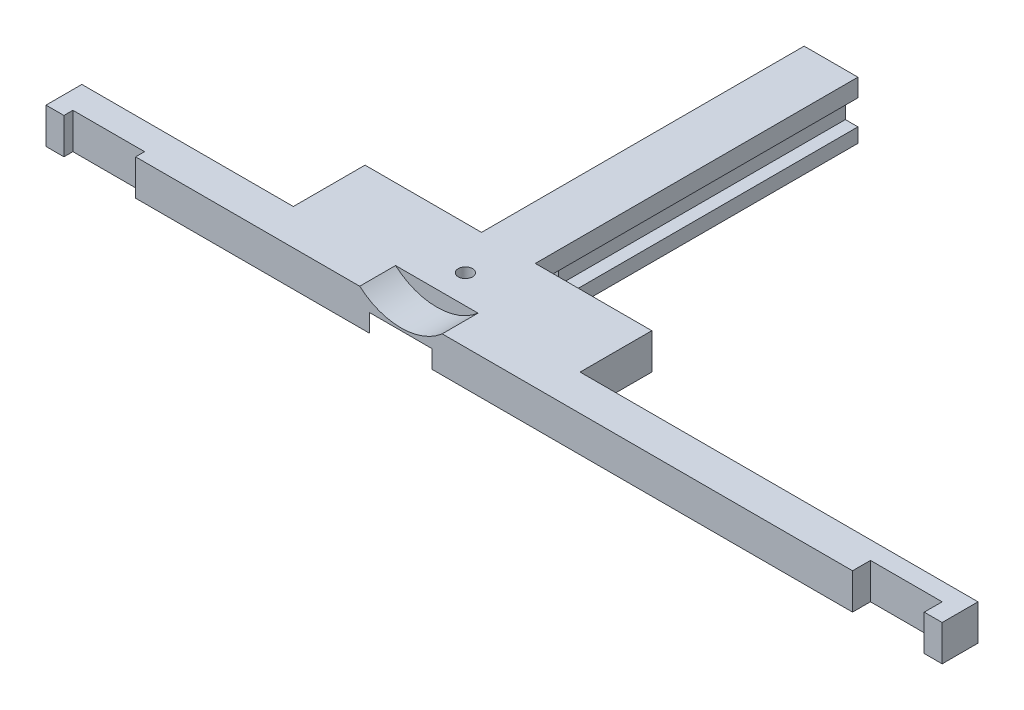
from build123d import *

# Parameters (mm, degrees)
EXTRUDE_1_DEPTH     = 10
CUT_EXTRUDE_START   = -10
SKETCH_3_R          = 20
CUT_EXTRUDE_1_DEPTH = 5
SKETCH_4_W          = 59
SKETCH_4_H          = 20
SKETCH_4_W_2        = 111
CUT_EXTRUDE_2_DEPTH = 10
SKETCH_5_R          = 2
EXTRUDE_2_DEPTH     = 10
SKETCH_6_W          = 15
SKETCH_6_H          = 5
EXTRUDE_3_DEPTH     = 10
EXTRUDE_4_DEPTH     = 80
SKETCH_9_R          = 17.5
CUT_EXTRUDE_3_DEPTH = 10
SKETCH_10_R         = 2
CUT_EXTRUDE_4_DEPTH = 10


with BuildPart() as part:
    # Sketch 2 → Extrude 1 (new body)
    with BuildSketch(Plane(origin=(0, 0, 0), x_dir=(1, 0, 0), z_dir=(0, 1, 0))):
        Polygon((-99, 30), (151, 30), (151, 0), (146, 0), (146, 5), (126, 5), (126, 0), (-74, 0), (-74, 2.5), (-94, 2.5), (-94, 0), (-99, 0), align=None)
    extrude(amount=EXTRUDE_1_DEPTH)

    # Sketch 3 → Cut-Extrude 1 (cut)
    with BuildSketch(Plane(origin=(0, 10, 0), x_dir=(1, 0, 0), z_dir=(0, 1, 0)).offset(CUT_EXTRUDE_START)):
        with Locations((0, 18)):
            Circle(SKETCH_3_R)
    extrude(amount=CUT_EXTRUDE_1_DEPTH, mode=Mode.SUBTRACT)

    # Sketch 4 → Cut-Extrude 2 (cut)
    with BuildSketch(Plane(origin=(0, 10, 0), x_dir=(1, 0, 0), z_dir=(0, 1, 0))):
        with Locations((-69.5, 20)):
            Rectangle(SKETCH_4_W, SKETCH_4_H)
        with Locations((95.5, 20)):
            Rectangle(SKETCH_4_W_2, SKETCH_4_H)
    extrude(amount=-CUT_EXTRUDE_2_DEPTH, mode=Mode.SUBTRACT)

    # Sketch 5 → Extrude 2 (add)
    with BuildSketch(Plane.XZ):
        with Locations(Location((-30, -18, 0), (0, 0, 270))):
            Circle(SKETCH_5_R)
        with Locations(Location((30, -18, 0), (0, 0, 90))):
            Circle(SKETCH_5_R)
    extrude(amount=EXTRUDE_2_DEPTH)

    # Sketch 6 → Extrude 3 (add)
    with BuildSketch(Plane(origin=(0, 0, -30), x_dir=(-1, 0, 0), z_dir=(0, 0, -1))):
        with Locations((0, 7.5)):
            Rectangle(SKETCH_6_W, SKETCH_6_H)
    extrude(amount=EXTRUDE_3_DEPTH)

    # Sketch 8 → Extrude 4 (add)
    with BuildSketch(Plane(origin=(0, 0, -40), x_dir=(-1, 0, 0), z_dir=(0, 0, -1))):
        Polygon((-7.5, 10), (7.5, 10), (7.5, 5), (4, 5), (4, -2), (7.5, -2), (7.5, -6), (-7.5, -6), (-7.5, -2), (-4, -2), (-4, 5), (-7.5, 5), align=None)
    extrude(amount=EXTRUDE_4_DEPTH)

    # Sketch 9 → Cut-Extrude 3 (cut)
    with BuildSketch(Plane.XY):
        with Locations((0.019237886, 23.187783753)):
            Circle(SKETCH_9_R)
    extrude(amount=-CUT_EXTRUDE_3_DEPTH, mode=Mode.SUBTRACT)

    # Sketch 10 → Cut-Extrude 4 (cut)
    with BuildSketch(Plane.XZ.offset(-5)):
        with Locations(Location((0, -18, 0), (0, 0, 270))):
            Circle(SKETCH_10_R)
    extrude(amount=-CUT_EXTRUDE_4_DEPTH, mode=Mode.SUBTRACT)


solid = part.part
